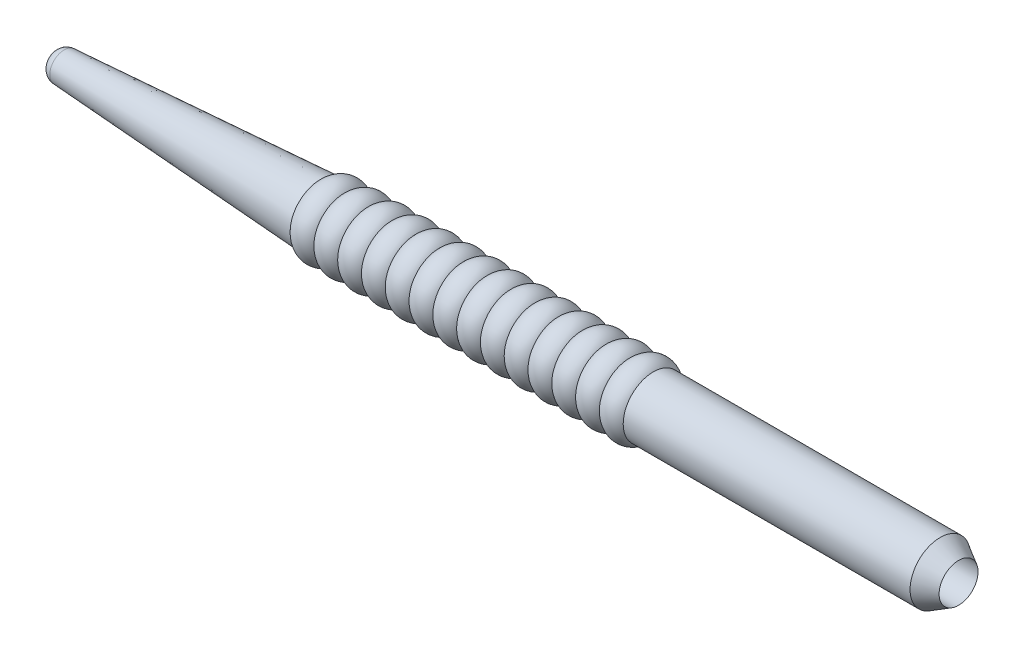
from build123d import *


with BuildPart() as part:
    # Sketch2 → Revolve2 (revolve)
    with BuildSketch(Plane.XY, mode=Mode.PRIVATE) as revolve2_sk:
        with BuildLine():
            Line((0, 0.6), (50, 3.658131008))
            Line((50, 3.658131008), (50, 5.658131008))
            Line((50, 5.658131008), (1.870676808, 2.714415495))
            ThreePointArc((1.870676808, 2.714415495), (0.497428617, 2.0446376), (0, 0.6))
        make_face()
    revolve(revolve2_sk.sketch.rotate(Axis((-19.275847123, 0, 0), (1, 0, 0)), 90), axis=Axis((-19.275847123, 0, 0), (1, 0, 0)))

    # Sketch4 → Revolve3 (revolve)
    with BuildSketch(Plane.XY, mode=Mode.PRIVATE) as revolve3_sk:
        with BuildLine():
            Line((112.60990337, 5.658131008), (120, 5.658131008))
            Line((120, 5.658131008), (120, 3.658131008))
            Line((120, 3.658131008), (112.60990337, 3.658131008))
            ThreePointArc((112.60990337, 3.658131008), (110.373835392, 2.658131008), (108.137767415, 3.658131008))
            ThreePointArc((108.137767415, 3.658131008), (105.901699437, 2.658131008), (103.66563146, 3.658131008))
            ThreePointArc((103.66563146, 3.658131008), (101.429563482, 2.658131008), (99.193495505, 3.658131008))
            ThreePointArc((99.193495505, 3.658131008), (96.957427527, 2.658131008), (94.72135955, 3.658131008))
            ThreePointArc((94.72135955, 3.658131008), (92.485291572, 2.658131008), (90.249223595, 3.658131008))
            ThreePointArc((90.249223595, 3.658131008), (88.013155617, 2.658131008), (85.77708764, 3.658131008))
            ThreePointArc((85.77708764, 3.658131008), (83.541019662, 2.658131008), (81.304951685, 3.658131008))
            ThreePointArc((81.304951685, 3.658131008), (79.068883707, 2.658131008), (76.83281573, 3.658131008))
            ThreePointArc((76.83281573, 3.658131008), (74.596747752, 2.658131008), (72.360679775, 3.658131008))
            ThreePointArc((72.360679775, 3.658131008), (70.124611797, 2.658131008), (67.88854382, 3.658131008))
            ThreePointArc((67.88854382, 3.658131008), (65.652475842, 2.658131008), (63.416407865, 3.658131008))
            ThreePointArc((63.416407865, 3.658131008), (61.180339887, 2.658131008), (58.94427191, 3.658131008))
            ThreePointArc((58.94427191, 3.658131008), (56.708203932, 2.658131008), (54.472135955, 3.658131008))
            ThreePointArc((54.472135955, 3.658131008), (52.236067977, 2.658131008), (50, 3.658131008))
            Line((50, 3.658131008), (50, 5.658131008))
            ThreePointArc((50, 5.658131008), (52.236067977, 6.658131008), (54.472135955, 5.658131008))
            ThreePointArc((54.472135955, 5.658131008), (56.708203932, 6.658131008), (58.94427191, 5.658131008))
            ThreePointArc((58.94427191, 5.658131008), (61.180339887, 6.658131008), (63.416407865, 5.658131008))
            ThreePointArc((63.416407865, 5.658131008), (65.652475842, 6.658131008), (67.88854382, 5.658131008))
            ThreePointArc((67.88854382, 5.658131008), (70.124611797, 6.658131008), (72.360679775, 5.658131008))
            ThreePointArc((72.360679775, 5.658131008), (74.596747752, 6.658131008), (76.83281573, 5.658131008))
            ThreePointArc((76.83281573, 5.658131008), (79.068883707, 6.658131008), (81.304951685, 5.658131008))
            ThreePointArc((81.304951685, 5.658131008), (83.541019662, 6.658131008), (85.77708764, 5.658131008))
            ThreePointArc((85.77708764, 5.658131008), (88.013155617, 6.658131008), (90.249223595, 5.658131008))
            ThreePointArc((90.249223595, 5.658131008), (92.485291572, 6.658131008), (94.72135955, 5.658131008))
            ThreePointArc((94.72135955, 5.658131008), (96.957427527, 6.658131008), (99.193495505, 5.658131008))
            ThreePointArc((99.193495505, 5.658131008), (101.429563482, 6.658131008), (103.66563146, 5.658131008))
            ThreePointArc((103.66563146, 5.658131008), (105.901699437, 6.658131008), (108.137767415, 5.658131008))
            ThreePointArc((108.137767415, 5.658131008), (110.373835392, 6.658131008), (112.60990337, 5.658131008))
        make_face()
    revolve(revolve3_sk.sketch.rotate(Axis((21.024758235, 0, 0), (1, 0, 0)), 90), axis=Axis((21.024758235, 0, 0), (1, 0, 0)))

    # Sketch5 → Revolve4 (revolve)
    with BuildSketch(Plane.XY, mode=Mode.PRIVATE) as revolve4_sk:
        Polygon((120, 3.658131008), (120, 5.658131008), (166.535898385, 5.658131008), (170, 3.658131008), align=None)
    revolve(revolve4_sk.sketch.rotate(Axis((115.901619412, 0, 0), (1, 0, 0)), 90), axis=Axis((115.901619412, 0, 0), (1, 0, 0)))


solid = part.part
